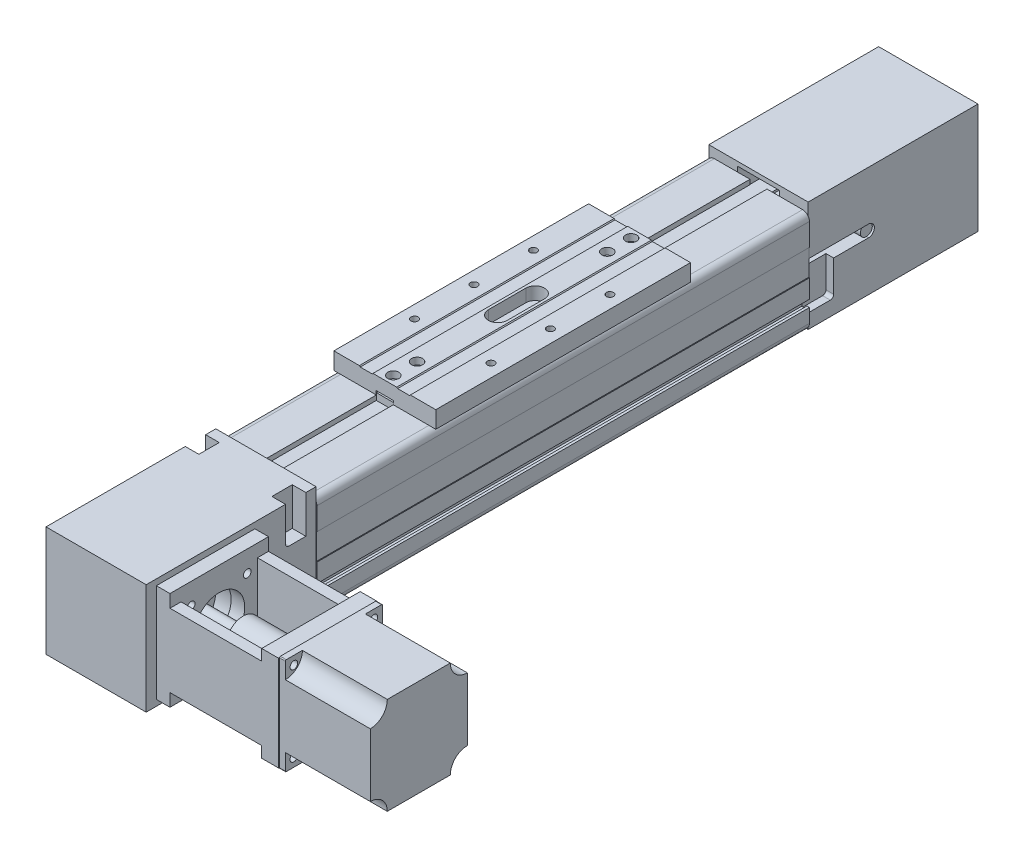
from build123d import *

# Parameters (mm, degrees)
SKETCH_2_W             = 58.5
SKETCH_2_H             = 65
EXTRUDE_1_DEPTH        = 100
SKETCH_3_W             = 25
SKETCH_3_H             = 60
CUT_EXTRUDE_2_DEPTH    = 52
CUT_EXTRUDE_3_DEPTH    = 121.32663878
CUT_EXTRUDE_4_DEPTH    = 4.5
SKETCH_12_W            = 59
SKETCH_12_H            = 65
EXTRUDE_9_DEPTH        = 100
SKETCH_13_W            = 8
SKETCH_13_H            = 12
CUT_EXTRUDE_10_DEPTH   = 22.3
FILLET_1_R             = 2
SKETCH_16_R            = 18.5
CUT_EXTRUDE_13_DEPTH   = 495.608178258
CUT_EXTRUDE_14_DEPTH   = 90
EXTRUDE_15_DEPTH       = 5.2
SKETCH_21_W            = 20
SKETCH_21_H            = 5
EXTRUDE_17_DEPTH       = 290
CUT_EXTRUDE_19_DEPTH   = 290
HOLE_WIZARD_M4_1_D     = 3.3
SKETCH_26_W            = 58
SKETCH_26_H            = 58
SKETCH_26_R            = 2.75
EXTRUDE_20_DEPTH       = 3
SKETCH_28_W            = 58
SKETCH_28_H            = 58
SKETCH_28_R            = 2.25
SKETCH_28_R_2          = 15
EXTRUDE_21_DEPTH       = 8
SKETCH_29_W            = 6.5
SKETCH_29_H            = 43
EXTRUDE_22_DEPTH       = 54
SKETCH_30_W            = 58
SKETCH_30_H            = 56
SKETCH_30_R            = 15
EXTRUDE_23_DEPTH       = 10
HOLE_WIZARD_M4_2_D     = 3.3
HOLE_WIZARD_M4_2_DEPTH = 11.5
HOLE_WIZARD_M4_2_TIP   = 0.991420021
SKETCH_34_R            = 19
CUT_EXTRUDE_25_DEPTH   = 3.5
SKETCH_35_R            = 18.5
EXTRUDE_26_DEPTH       = 3.5
EXTRUDE_27_REACH       = 506.168
SKETCH_36_R            = 3.175
SKETCH_37_W            = 57.1
SKETCH_37_H            = 57.1
SKETCH_37_R            = 2.25
EXTRUDE_28_DEPTH       = 53.5
SKETCH_38_R            = 10
CUT_EXTRUDE_29_DEPTH   = 50
SKETCH_42_W            = 10
SKETCH_42_H            = 150
EXTRUDE_31_DEPTH       = 4
EXTRUDE_32_DEPTH       = 150
FILLET_9_R             = 0.5
CUT_EXTRUDE_1_DEPTH    = 290
CUT_EXTRUDE_2_2_DEPTH  = 7.5
SKETCH_53_R            = 1.7
CUT_EXTRUDE_3_2_DEPTH  = 9
HOLE_WIZARD_1_D        = 6.5
HOLE_WIZARD_1_DEPTH    = 4
HOLE_WIZARD_M5_1_D     = 4.2
HOLE_WIZARD_M5_1_DEPTH = 10
HOLE_WIZARD_M5_1_TIP   = 1.2618073


with BuildPart() as part:
    # Sketch 2 → Extrude 1 (new body)
    with BuildSketch(Plane.XY):
        Rectangle(SKETCH_2_W, SKETCH_2_H)
    extrude(amount=EXTRUDE_1_DEPTH)

    # Sketch 3 → Cut-Extrude 2 (cut)
    with BuildSketch(Plane.XY.offset(100)):
        Rectangle(SKETCH_3_W, SKETCH_3_H)
    extrude(amount=-CUT_EXTRUDE_2_DEPTH, mode=Mode.SUBTRACT)

    # Sketch 4 → Cut-Extrude 3 (cut, through all)
    with BuildSketch(Plane.ZY.offset(29.25)):
        with BuildLine():
            Line((64.5, 3.5), (100, 3.5))
            Line((100, 3.5), (100, -3.5))
            Line((100, -3.5), (64.5, -3.5))
            ThreePointArc((64.5, -3.5), (61, 0), (64.5, 3.5))
        make_face()
    extrude(amount=-CUT_EXTRUDE_3_DEPTH, mode=Mode.SUBTRACT)

    # Sketch 5 → Cut-Extrude 4 (cut)
    with BuildSketch(Plane.ZY.offset(29.25)):
        with BuildLine():
            Line((100, -3.5), (85, -3.5))
            Line((85, -3.5), (85, -22))
            ThreePointArc((85, -22), (85.585786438, -23.414213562), (87, -24))
            Line((87, -24), (100, -24))
            Line((100, -24), (100, -3.5))
        make_face()
    cut_extrude_4 = extrude(amount=-CUT_EXTRUDE_4_DEPTH, mode=Mode.SUBTRACT)

    # Mirror 1: Cut-Extrude 4 across plane
    add(cut_extrude_4.mirror(Plane(origin=(0, 0, 0), x_dir=(0, 0, 1), z_dir=(1, 0, 0))), mode=Mode.SUBTRACT)

    # Sketch 11 → Revolve 1 (revolve)
    with BuildSketch(Plane.XY.offset(64.5), mode=Mode.PRIVATE) as revolve_1_sk:
        Polygon((-28, 0), (-28, 3.5), (-10, 3.5), (-10, 25), (-5.2, 25), (-5.2, 24), (5.2, 24), (5.2, 25), (10, 25), (10, 3.5), (28, 3.5), (28, 0), align=None)
    revolve(revolve_1_sk.sketch.rotate(Axis((-28, 0, 64.5), (1, 0, 0)), 180), axis=Axis((-28, 0, 64.5), (1, 0, 0)))



with BuildPart() as body_2:
    # Sketch 12 → Extrude 9 (new body)
    with BuildSketch(Plane.XY.offset(390)):
        Rectangle(SKETCH_12_W, SKETCH_12_H)
    extrude(amount=EXTRUDE_9_DEPTH)

    # Sketch 13 → Cut-Extrude 10 (cut)
    with BuildSketch(Plane(origin=(0, 32.5, 0), x_dir=(1, 0, 0), z_dir=(0, 1, 0))):
        with Locations((25.5, -402)):
            Rectangle(SKETCH_13_W, SKETCH_13_H)
        with Locations((-25.5, -402)):
            Rectangle(SKETCH_13_W, SKETCH_13_H)
    extrude(amount=-CUT_EXTRUDE_10_DEPTH, mode=Mode.SUBTRACT)

    # Fillet 1
    fillet_1_edges = [body_2.edges().sort_by_distance(p)[0] for p in [
        (25.5, 10.2, 408),
        (-25.5, 10.2, 408),
    ]]
    fillet(fillet_1_edges, radius=FILLET_1_R)

    # Sketch 16 → Cut-Extrude 13 (cut, through all)
    with BuildSketch(Plane.ZY.offset(29.5)):
        with Locations((455, -3.5)):
            Circle(SKETCH_16_R)
    extrude(amount=-CUT_EXTRUDE_13_DEPTH, mode=Mode.SUBTRACT)

    # Sketch 17 → Cut-Extrude 14 (cut)
    with BuildSketch(Plane(origin=(0, 0, 390), x_dir=(-1, 0, 0), z_dir=(0, 0, -1))):
        with BuildLine():
            Line((-15, 28.5), (15, 28.5))
            ThreePointArc((15, 28.5), (19, 24.5), (15, 20.5))
            Line((15, 20.5), (-15, 20.5))
            ThreePointArc((-15, 20.5), (-19, 24.5), (-15, 28.5))
        make_face()
        with BuildLine():
            Line((-15, -20.5), (15, -20.5))
            ThreePointArc((15, -20.5), (19, -24.5), (15, -28.5))
            Line((15, -28.5), (-15, -28.5))
            ThreePointArc((-15, -28.5), (-19, -24.5), (-15, -20.5))
        make_face()
    extrude(amount=-CUT_EXTRUDE_14_DEPTH, mode=Mode.SUBTRACT)

    # Sketch 19 → Revolve 2 (revolve)
    with BuildSketch(Plane.XY.offset(455), mode=Mode.PRIVATE) as revolve_2_sk:
        Polygon((-28, 0), (-28, 4), (-17, 4), (-17, 29), (-5.2, 29), (-5.2, 24), (5.2, 24), (5.2, 29), (17, 29), (17, 4), (51.5, 4), (51.5, 10), (81.5, 10), (81.5, 0), align=None)
    revolve(revolve_2_sk.sketch.rotate(Axis((-28, 0, 455), (1, 0, 0)), 180), axis=Axis((-28, 0, 455), (1, 0, 0)))


with BuildPart() as part_1:
    add(part.part)

    add(body_2.part)  # Extrude 15 merges body 2
    # Sketch 20 → Extrude 15 (add, symmetric)
    with BuildSketch(Plane(origin=(0, 0, 0), x_dir=(0, 0, -1), z_dir=(1, 0, 0))):
        with BuildLine():
            Line((-455, 24.2), (-64.5, 24.2))
            ThreePointArc((-64.5, 24.2), (-40.300001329, -0.008019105), (-64.516038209, -24.199994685))
            Line((-64.516038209, -24.199994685), (-435.554135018, -14.404802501))
            ThreePointArc((-435.554135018, -14.404802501), (-476.612915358, -10.886775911), (-455, 24.2))
        make_face()
        with BuildLine():
            Line((-455, 23), (-64.5, 23))
            ThreePointArc((-64.5, 23), (-41.5, 0), (-64.5, -23))
            Line((-64.5, -23), (-436.156853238, -13.188473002))
            ThreePointArc((-436.156853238, -13.188473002), (-475.40018234, -10.622267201), (-455, 23))
        make_face(mode=Mode.SUBTRACT)
    extrude(amount=EXTRUDE_15_DEPTH, both=True)

    # Sketch 21 → Extrude 17 (add)
    with BuildSketch(Plane.XY.offset(100)):
        with BuildLine():
            Line((-5, 27), (-5, 22))
            Line((-5, 22), (5, 22))
            Line((5, 22), (5, 27))
            Line((5, 27), (26, 27))
            ThreePointArc((26, 27), (28.828427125, 25.828427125), (30, 23))
            Line((30, 23), (30, -29))
            ThreePointArc((30, -29), (28.828427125, -31.828427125), (26, -33))
            Line((26, -33), (-26, -33))
            ThreePointArc((-26, -33), (-28.828427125, -31.828427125), (-30, -29))
            Line((-30, -29), (-30, 23))
            ThreePointArc((-30, 23), (-28.828427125, 25.828427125), (-26, 27))
            Line((-26, 27), (-5, 27))
        make_face()
        with Locations((0, -25.5)):
            Rectangle(SKETCH_21_W, SKETCH_21_H, mode=Mode.SUBTRACT)
    extrude(amount=EXTRUDE_17_DEPTH)

    # Sketch 22 → Cut-Extrude 19 (cut)
    with BuildSketch(Plane(origin=(0, 0, 100), x_dir=(-1, 0, 0), z_dir=(0, 0, -1))):
        Polygon((29.75, -5.5), (30, -5.75), (30, 9.75), (29.75, 9.5), align=None)
        Polygon((-30, -16.7), (-30, -20.9), (-28.5, -20.9), (-28.5, -22.5), (-25.5, -22.5), (-25.5, -15.1), (-28.5, -15.1), (-28.5, -16.7), align=None)
        Polygon((-29.75, -5.5), (-29.75, 9.5), (-30, 9.75), (-30, -5.75), align=None)
        Polygon((30, -16.7), (28.5, -16.7), (28.5, -15.1), (25.5, -15.1), (25.5, -22.5), (28.5, -22.5), (28.5, -20.9), (30, -20.9), align=None)
    extrude(amount=-CUT_EXTRUDE_19_DEPTH, mode=Mode.SUBTRACT)

    # Hole Wizard M4 _1 (through all)
    with Locations(Plane(origin=(-29.5, 16.5, 438.5), x_dir=(0, 0, -1), z_dir=(-1, 0, 0))):
        with Locations((0, 0), (-33, 0), (-33, 33), (0, 33)):
            Hole(HOLE_WIZARD_M4_1_D / 2)

    # Sketch 26 → Extrude 20 (add)
    with BuildSketch(Plane.ZY.offset(29.5)):
        with Locations((455, 0)):
            Rectangle(SKETCH_26_W, SKETCH_26_H)
        with Locations((438.5, 16.5)):
            Circle(SKETCH_26_R, mode=Mode.SUBTRACT)
        with Locations(Location((438.5, -16.5, 0), (0, 0, 180))):
            Circle(SKETCH_26_R, mode=Mode.SUBTRACT)
        with Locations(Location((471.5, -16.5, 0), (0, 0, 164.492950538))):
            Circle(SKETCH_26_R, mode=Mode.SUBTRACT)
        with Locations(Location((471.5, 16.5, 0), (0, 0, 180))):
            Circle(SKETCH_26_R, mode=Mode.SUBTRACT)
    extrude(amount=EXTRUDE_20_DEPTH)

    # Sketch 28 → Extrude 21 (add)
    with BuildSketch(Plane(origin=(29.5, 0, 0), x_dir=(0, 0, -1), z_dir=(1, 0, 0))):
        with Locations((-455, 0)):
            Rectangle(SKETCH_28_W, SKETCH_28_H)
        with Locations((-471.5, 16.5)):
            Circle(SKETCH_28_R, mode=Mode.SUBTRACT)
        with Locations(Location((-438.5, 16.5, 0), (0, 0, 180))):
            Circle(SKETCH_28_R, mode=Mode.SUBTRACT)
        with Locations((-438.5, -16.5)):
            Circle(SKETCH_28_R, mode=Mode.SUBTRACT)
        with Locations(Location((-471.5, -16.5, 0), (0, 0, 180))):
            Circle(SKETCH_28_R, mode=Mode.SUBTRACT)
        with Locations(Location((-455, 0, 0), (0, 0, 89.999519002))):
            Circle(SKETCH_28_R_2, mode=Mode.SUBTRACT)
    extrude(amount=EXTRUDE_21_DEPTH)

    # Sketch 29 → Extrude 22 (add)
    with BuildSketch(Plane(origin=(37.5, 0, 0), x_dir=(0, 0, -1), z_dir=(1, 0, 0))):
        with Locations((-480.75, 0)):
            Rectangle(SKETCH_29_W, SKETCH_29_H)
        with Locations((-429.25, 0)):
            Rectangle(SKETCH_29_W, SKETCH_29_H)
    extrude(amount=EXTRUDE_22_DEPTH)

    # Sketch 30 → Extrude 23 (add)
    with BuildSketch(Plane(origin=(91.5, 0, 0), x_dir=(0, 0, -1), z_dir=(1, 0, 0))):
        with Locations((-455, 0)):
            Rectangle(SKETCH_30_W, SKETCH_30_H)
        with Locations(Location((-455, 0, 0), (0, 0, 89.999519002))):
            Circle(SKETCH_30_R, mode=Mode.SUBTRACT)
    extrude(amount=EXTRUDE_23_DEPTH)

    # Hole Wizard M4 _2
    with Locations(Plane(origin=(101.5, 23.55, 478.55), x_dir=(0, 0, 1), z_dir=(1, 0, 0))):
        with Locations((0, 0), (-47.1, 0), (-47.1, 47.1), (0, 47.1)):
            Hole(HOLE_WIZARD_M4_2_D / 2, depth=HOLE_WIZARD_M4_2_DEPTH)
            with Locations((0, 0, -(HOLE_WIZARD_M4_2_DEPTH + HOLE_WIZARD_M4_2_TIP / 2))):  # 118° drill point
                Cone(0, HOLE_WIZARD_M4_2_D / 2, HOLE_WIZARD_M4_2_TIP, mode=Mode.SUBTRACT)

    # Sketch 34 → Cut-Extrude 25 (cut)
    with BuildSketch(Plane(origin=(101.5, 0, 0), x_dir=(0, 0, -1), z_dir=(1, 0, 0))):
        with Locations((-455, 0)):
            Circle(SKETCH_34_R)
    extrude(amount=-CUT_EXTRUDE_25_DEPTH, mode=Mode.SUBTRACT)

    # Sketch 35 → Extrude 26 (add)
    with BuildSketch(Plane(origin=(98, 0, 0), x_dir=(0, 0, -1), z_dir=(1, 0, 0))):
        with Locations((-455, 0)):
            Circle(SKETCH_35_R)
    extrude(amount=EXTRUDE_26_DEPTH)

    # Sketch 36 → Extrude 27 (add, up to next)
    with BuildSketch(Plane(origin=(81.5, 0, 0), x_dir=(0, 0, -1), z_dir=(1, 0, 0)), mode=Mode.PRIVATE) as extrude_27_sk1:
        with Locations(Location((-455, 0, 0), (0, 0, 270))):
            Circle(SKETCH_36_R)
    extrude_27_tool1 = extrude(extrude_27_sk1.sketch, amount=EXTRUDE_27_REACH, mode=Mode.PRIVATE) - part_1.part
    add(extrude_27_tool1.solids().sort_by_distance((81.5, 0, 455))[0])

    # Sketch 37 → Extrude 28 (add)
    with BuildSketch(Plane(origin=(101.5, 0, 0), x_dir=(0, 0, -1), z_dir=(1, 0, 0))):
        with Locations((-455, 0)):
            Rectangle(SKETCH_37_W, SKETCH_37_H)
        with Locations((-478.55, 23.55)):
            Circle(SKETCH_37_R, mode=Mode.SUBTRACT)
        with Locations(Location((-478.55, -23.55, 0), (0, 0, 180))):
            Circle(SKETCH_37_R, mode=Mode.SUBTRACT)
        with Locations((-431.45, -23.55)):
            Circle(SKETCH_37_R, mode=Mode.SUBTRACT)
        with Locations(Location((-431.45, 23.55, 0), (0, 0, 180))):
            Circle(SKETCH_37_R, mode=Mode.SUBTRACT)
    extrude(amount=EXTRUDE_28_DEPTH)

    # Sketch 38 → Cut-Extrude 29 (cut)
    with BuildSketch(Plane(origin=(155, 0, 0), x_dir=(0, 0, -1), z_dir=(1, 0, 0))):
        with Locations((-483.55, 28.55)):
            Circle(SKETCH_38_R)
        with Locations((-483.55, -28.55)):
            Circle(SKETCH_38_R)
        with Locations((-426.45, -28.55)):
            Circle(SKETCH_38_R)
        with Locations((-426.45, 28.55)):
            Circle(SKETCH_38_R)
    extrude(amount=-CUT_EXTRUDE_29_DEPTH, mode=Mode.SUBTRACT)

    # Sketch 42 → Extrude 31 (add)
    with BuildSketch(Plane(origin=(0, 24.2, 0), x_dir=(1, 0, 0), z_dir=(0, 1, 0))):
        with Locations((0, -245)):
            Rectangle(SKETCH_42_W, SKETCH_42_H)
    extrude(amount=EXTRUDE_31_DEPTH)

    # Sketch 43 → Extrude 32 (add)
    with BuildSketch(Plane(origin=(0, 0, 170), x_dir=(-1, 0, 0), z_dir=(0, 0, -1))):
        Polygon((5.25, 29.2), (-5.25, 29.2), (-5.25, 27), (-30, 27), (-30, 37), (-15, 37), (-14.5, 36.5), (-7.5, 36.5), (-7, 37), (7, 37), (7.5, 36.5), (14.5, 36.5), (15, 37), (30, 37), (30, 27), (5.25, 27), align=None)
    extrude(amount=-EXTRUDE_32_DEPTH)

    # Fillet 9
    fillet_9_edges = [part_1.edges().sort_by_distance(p)[0] for p in [
        (103.25, 28.55, 483.55),
        (103.25, -28.55, 483.55),
        (103.25, -28.55, 426.45),
        (103.25, 28.55, 426.45),
    ]]
    fillet(fillet_9_edges, radius=FILLET_9_R)

    # Sketch 51 → Cut-Extrude 1 (cut)
    with BuildSketch(Plane(origin=(0, 0, 100), x_dir=(-1, 0, 0), z_dir=(0, 0, -1))):
        Polygon((-26, -25.5), (-16, -25.5), (-16, -29.5), (-18, -29.5), (-18, -34.29444864), (-24, -34.29444864), (-24, -29.5), (-26, -29.5), align=None)
        Polygon((16, -25.5), (26, -25.5), (26, -29.5), (24, -29.5), (24, -34.812622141), (18, -34.812622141), (18, -29.5), (16, -29.5), align=None)
    extrude(amount=-CUT_EXTRUDE_1_DEPTH, mode=Mode.SUBTRACT)

    # Sketch 52 → Cut-Extrude 2 2 (cut)
    with BuildSketch(Plane(origin=(0, 37, 0), x_dir=(1, 0, 0), z_dir=(0, 1, 0))):
        with BuildLine():
            Line((-5.5, -231.5), (-5.5, -253.5))
            ThreePointArc((-5.5, -253.5), (0, -259), (5.5, -253.5))
            Line((5.5, -253.5), (5.5, -231.5))
            ThreePointArc((5.5, -231.5), (0, -226), (-5.5, -231.5))
        make_face()
    extrude(amount=-CUT_EXTRUDE_2_2_DEPTH, mode=Mode.SUBTRACT)

    # Sketch 53 → Cut-Extrude 3 2 (cut)
    with BuildSketch(Plane(origin=(0, 37, 0), x_dir=(1, 0, 0), z_dir=(0, 1, 0))):
        with Locations(Location((0, -175, 0), (0, 0, 180))):
            Circle(SKETCH_53_R)
        with Locations(Location((0, -189, 0), (0, 0, 180))):
            Circle(SKETCH_53_R)
        with Locations(Location((0, -301, 0), (0, 0, 180))):
            Circle(SKETCH_53_R)
        with Locations(Location((0, -315, 0), (0, 0, 180))):
            Circle(SKETCH_53_R)
    extrude(amount=-CUT_EXTRUDE_3_2_DEPTH, mode=Mode.SUBTRACT)

    # Hole Wizard 1
    with Locations(Plane(origin=(0, 37, 0), x_dir=(-1, 0, 0), z_dir=(0, 1, 0))):
        with Locations((0, 175), (0, 189), (0, 301), (0, 315)):
            Hole(HOLE_WIZARD_1_D / 2, depth=HOLE_WIZARD_1_DEPTH)

    # Hole Wizard M5 _1
    with Locations(Plane(origin=(0, 37, 0), x_dir=(-1, 0, 0), z_dir=(0, 1, 0))):
        with Locations((22.5, 280), (22.5, 245), (22.5, 210), (-22.5, 210), (-22.5, 245), (-22.5, 280)):
            Hole(HOLE_WIZARD_M5_1_D / 2, depth=HOLE_WIZARD_M5_1_DEPTH)
            with Locations((0, 0, -(HOLE_WIZARD_M5_1_DEPTH + HOLE_WIZARD_M5_1_TIP / 2))):  # 118° drill point
                Cone(0, HOLE_WIZARD_M5_1_D / 2, HOLE_WIZARD_M5_1_TIP, mode=Mode.SUBTRACT)


solid = part_1.part
